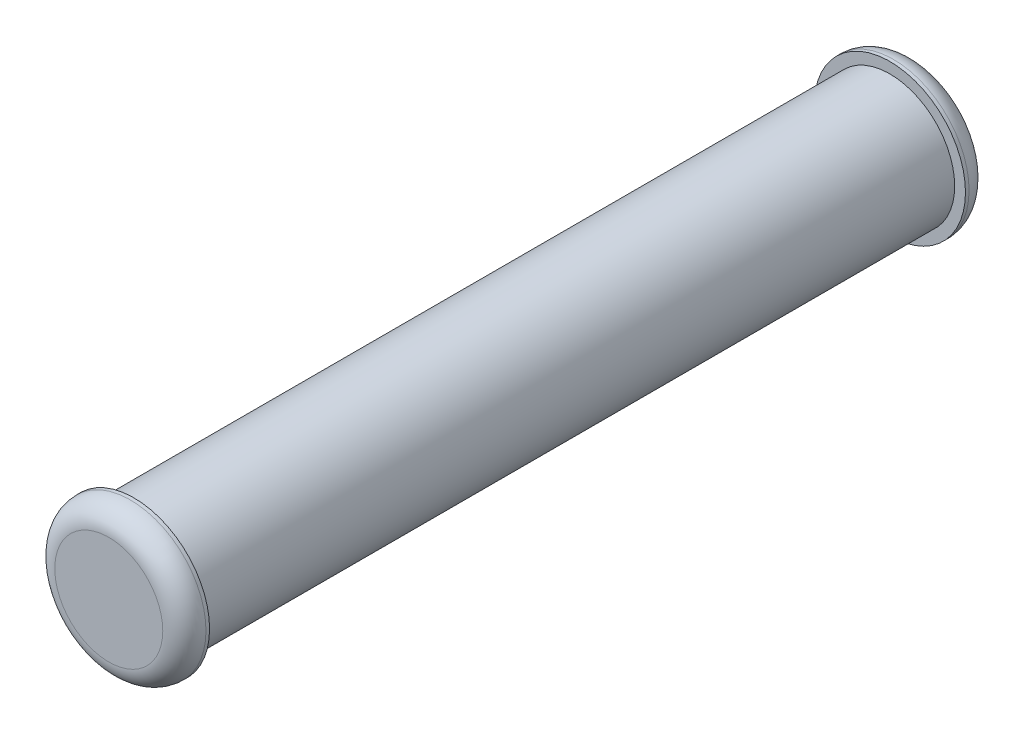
from build123d import *


with BuildPart() as part:
    # Esquisse1 → Base-R_volution (revolve)
    with BuildSketch(Plane(origin=(0, 0, 0), x_dir=(0, 0, -1), z_dir=(1, 0, 0)), mode=Mode.PRIVATE) as base_r_volution_sk:
        with BuildLine():
            Line((-5.25, 0.9), (5.25, 0.9))
            Line((5.25, 0.9), (5.25, 1.05))
            Line((5.25, 1.05), (5.3, 1.05))
            ThreePointArc((5.3, 1.05), (5.512132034, 0.962132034), (5.6, 0.75))
            Line((5.6, 0.75), (5.6, 0))
            Line((5.6, 0), (-5.6, 0))
            Line((-5.6, 0), (-5.6, 0.75))
            ThreePointArc((-5.6, 0.75), (-5.512132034, 0.962132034), (-5.3, 1.05))
            Line((-5.3, 1.05), (-5.25, 1.05))
            Line((-5.25, 1.05), (-5.25, 0.9))
        make_face()
    revolve(base_r_volution_sk.sketch.rotate(Axis((0, 0, 13.5), (0, 0, -1)), 90), axis=Axis((0, 0, 13.5), (0, 0, -1)))


solid = part.part
